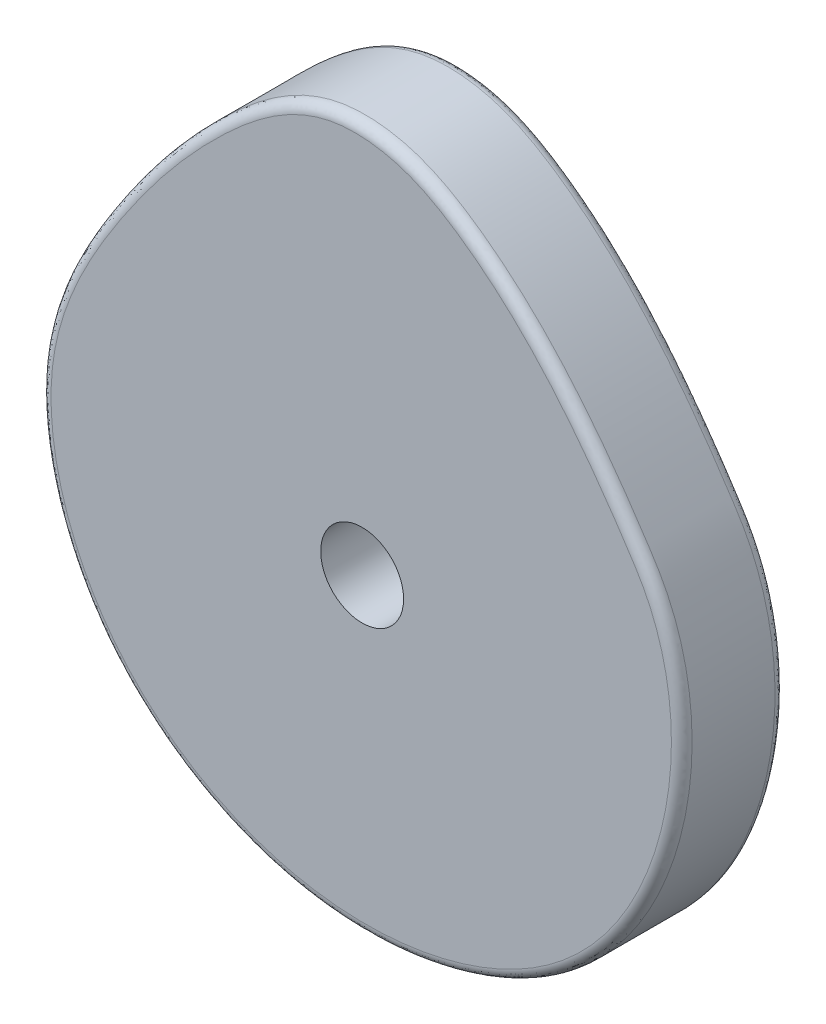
from build123d import *

# Parameters (mm, degrees)
SKETCH2_R           = 4
BOSS_EXTRUDE1_DEPTH = 10
FILLET1_R           = 1


with BuildPart() as part:
    # Sketch2 → Boss-Extrude1 (new body)
    with BuildSketch(Plane.XY):
        with BuildLine():
            add(Edge.make_bspline(
                [(-24.312650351, 18.381658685), (-21.372852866, 22.879831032), (-15.52711507, 30.257980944), (-5.228605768, 38.34648723), (4.206042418, 37.392659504), (15.463288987, 30.832858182), (22.552967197, 21.649989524), (32.850367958, 5.665681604), (30.774279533, -12.52800778), (15.729361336, -28.359539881), (-5.534064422, -32.565213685), (-27.172193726, -20.051285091), (-33.530535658, 2.188724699), (-27.285088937, 13.833542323), (-24.312650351, 18.381658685)],
                knots=[0, 0, 0, 0, 0.081511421, 0.146780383, 0.186019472, 0.217893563, 0.344142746, 0.357018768, 0.508530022, 0.56753076, 0.686491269, 0.806426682, 0.917583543, 1, 1, 1, 1], degree=3))
        make_face()
        Circle(SKETCH2_R, mode=Mode.SUBTRACT)
    extrude(amount=BOSS_EXTRUDE1_DEPTH)

    # Fillet1
    fillet1_edges = [part.edges().sort_by_distance(p)[0] for p in [
        (26.764936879, -15.016246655, 0),
        (26.764936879, -15.016246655, 10),
    ]]
    fillet(fillet1_edges, radius=FILLET1_R)


solid = part.part
